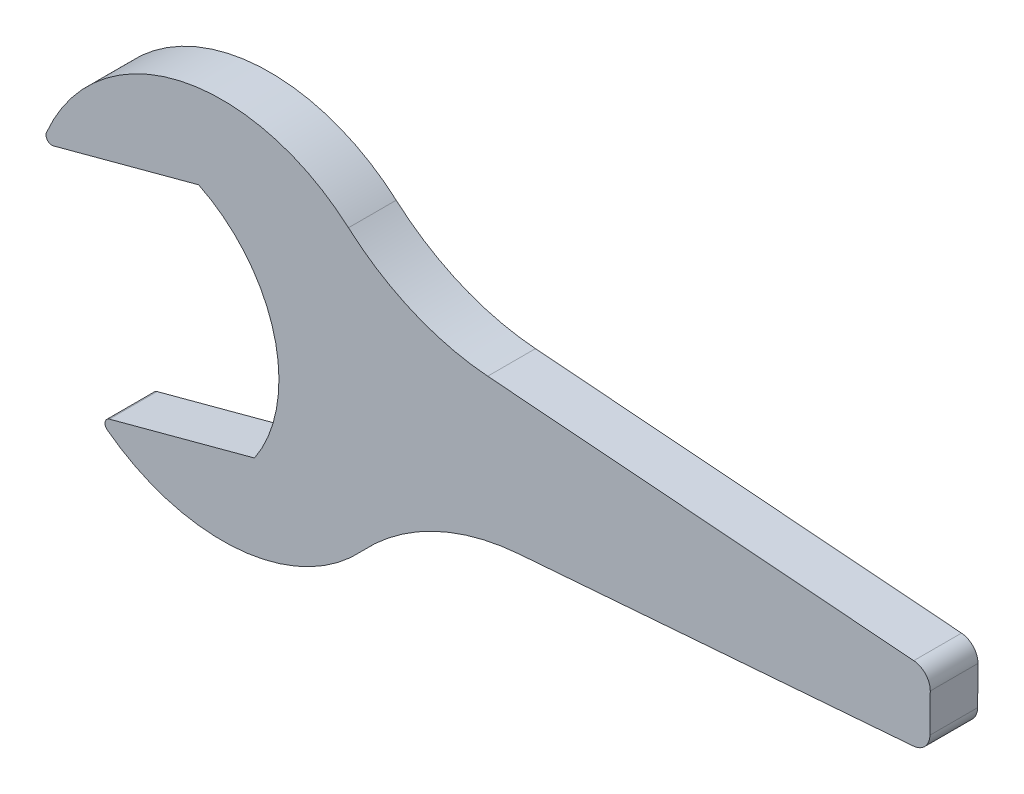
from build123d import *

# Parameters (mm, degrees)
BOSS_EXTRUDE1_DEPTH = 40
FILLET1_R           = 5
FILLET2_R           = 200
FILLET3_R           = 15


with BuildPart() as part:
    # Sketch1 → Boss-Extrude1 (new body)
    with BuildSketch(Plane.XY):
        with BuildLine():
            Line((-194.339846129, 41.6192895), (-63.217367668, 76.753451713))
            ThreePointArc((-63.217367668, 76.753451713), (0, 0), (-16.371120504, -98.079122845))
            Line((-16.371120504, -98.079122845), (-147.493598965, -133.213285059))
            ThreePointArc((-147.493598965, -133.213285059), (-1.88448773, -166.149034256), (107.524129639, -64.578707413))
            Line((107.524129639, -64.578707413), (549.425609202, -30.02245839))
            Line((549.425609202, -30.02245839), (550, 29.97754161))
            Line((550, 29.97754161), (96.749243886, 65.421292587))
            ThreePointArc((96.749243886, 65.421292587), (-56.506149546, 147.820919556), (-194.339846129, 41.6192895))
        make_face()
    extrude(amount=BOSS_EXTRUDE1_DEPTH)

    # Fillet1
    fillet1_edges = [part.edges().sort_by_distance(p)[0] for p in [
        (-147.493598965, -133.213285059, 20),
        (-194.339846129, 41.6192895, 20),
    ]]
    fillet(fillet1_edges, radius=FILLET1_R)

    # Fillet2
    fillet2_edges = [part.edges().sort_by_distance(p)[0] for p in [
        (107.524129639, -64.578707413, 20),
        (96.749243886, 65.421292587, 20),
    ]]
    fillet(fillet2_edges, radius=FILLET2_R)

    # Fillet3
    fillet3_edges = [part.edges().sort_by_distance(p)[0] for p in [
        (549.425609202, -30.02245839, 20),
        (550, 29.97754161, 20),
    ]]
    fillet(fillet3_edges, radius=FILLET3_R)


solid = part.part
